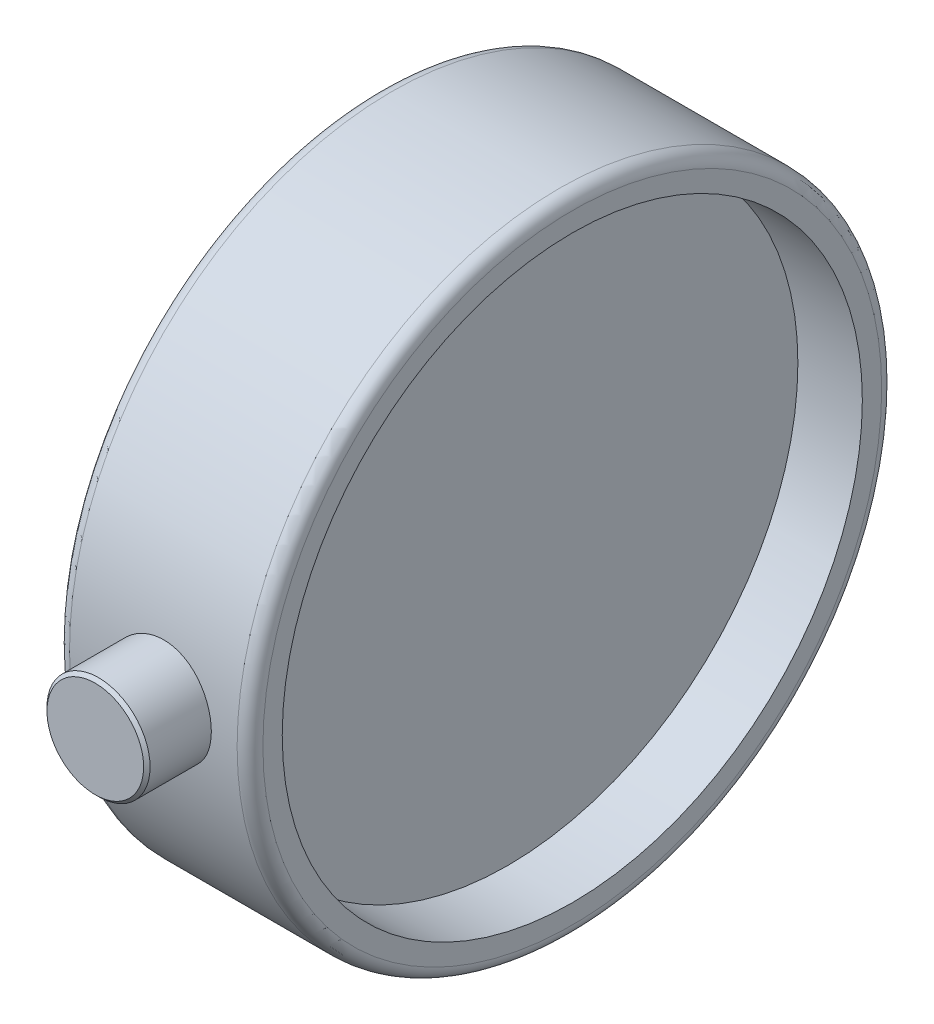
ISO-10303-21;
HEADER;
FILE_DESCRIPTION(('STEP AP214'),'2;1');
FILE_NAME('part.step','',(''),(''),'','','');
FILE_SCHEMA(('AUTOMOTIVE_DESIGN { 1 0 10303 214 1 1 1 1 }'));
ENDSEC;
DATA;
#1=APPLICATION_CONTEXT('core data for automotive mechanical design processes');
#2=APPLICATION_PROTOCOL_DEFINITION('international standard','automotive_design',2000,#1);
#3=PRODUCT_CONTEXT('',#1,'mechanical');
#4=PRODUCT('Part','Part','',(#3));
#5=PRODUCT_RELATED_PRODUCT_CATEGORY('part','',(#4));
#6=PRODUCT_DEFINITION_FORMATION('','',#4);
#7=PRODUCT_DEFINITION_CONTEXT('part definition',#1,'design');
#8=PRODUCT_DEFINITION('design','',#6,#7);
#9=PRODUCT_DEFINITION_SHAPE('','',#8);
#10=(LENGTH_UNIT() NAMED_UNIT(*) SI_UNIT(.MILLI.,.METRE.));
#11=(NAMED_UNIT(*) PLANE_ANGLE_UNIT() SI_UNIT($,.RADIAN.));
#12=(NAMED_UNIT(*) SI_UNIT($,.STERADIAN.) SOLID_ANGLE_UNIT());
#13=UNCERTAINTY_MEASURE_WITH_UNIT(LENGTH_MEASURE(1.E-05),#10,'distance_accuracy_value','');
#14=(GEOMETRIC_REPRESENTATION_CONTEXT(3) GLOBAL_UNCERTAINTY_ASSIGNED_CONTEXT((#13)) GLOBAL_UNIT_ASSIGNED_CONTEXT((#10,
#11,#12)) REPRESENTATION_CONTEXT('',''));
#15=CARTESIAN_POINT('',(0.,0.,0.));
#16=DIRECTION('',(0.,0.,1.));
#17=DIRECTION('',(1.,0.,0.));
#18=AXIS2_PLACEMENT_3D('',#15,#16,#17);
#19=CARTESIAN_POINT('',(20.,0.,0.));
#20=DIRECTION('',(1.,0.,0.));
#21=DIRECTION('',(0.,0.,-1.));
#22=AXIS2_PLACEMENT_3D('',#19,#20,#21);
#23=PLANE('',#22);
#24=CARTESIAN_POINT('',(20.,0.,0.));
#25=DIRECTION('',(1.,0.,0.));
#26=DIRECTION('',(0.,0.,-1.));
#27=AXIS2_PLACEMENT_3D('',#24,#25,#26);
#28=CIRCLE('',#27,45.);
#29=CARTESIAN_POINT('',(20.,0.,-45.));
#30=VERTEX_POINT('',#29);
#31=EDGE_CURVE('E142',#30,#30,#28,.T.);
#32=ORIENTED_EDGE('',*,*,#31,.T.);
#33=EDGE_LOOP('',(#32));
#34=FACE_BOUND('',#33,.T.);
#35=ADVANCED_FACE('F16',(#34),#23,.T.);
#36=CARTESIAN_POINT('',(30.,0.,0.));
#37=DIRECTION('',(1.,0.,0.));
#38=DIRECTION('',(0.,0.,-1.));
#39=AXIS2_PLACEMENT_3D('',#36,#37,#38);
#40=CYLINDRICAL_SURFACE('',#39,45.);
#41=CARTESIAN_POINT('',(30.,0.,0.));
#42=DIRECTION('',(1.,0.,0.));
#43=DIRECTION('',(0.,0.,-1.));
#44=AXIS2_PLACEMENT_3D('',#41,#42,#43);
#45=CIRCLE('',#44,45.);
#46=CARTESIAN_POINT('',(30.,0.,-45.));
#47=VERTEX_POINT('',#46);
#48=EDGE_CURVE('E152',#47,#47,#45,.F.);
#49=ORIENTED_EDGE('',*,*,#48,.F.);
#50=EDGE_LOOP('',(#49));
#51=FACE_BOUND('',#50,.T.);
#52=ORIENTED_EDGE('',*,*,#31,.F.);
#53=EDGE_LOOP('',(#52));
#54=FACE_BOUND('',#53,.T.);
#55=ADVANCED_FACE('F160',(#51,#54),#40,.F.);
#56=CARTESIAN_POINT('',(0.,0.,60.));
#57=DIRECTION('',(0.,0.,1.));
#58=DIRECTION('',(1.,0.,0.));
#59=AXIS2_PLACEMENT_3D('',#56,#57,#58);
#60=PLANE('',#59);
#61=CARTESIAN_POINT('',(16.,0.,60.));
#62=DIRECTION('',(0.,0.,-1.));
#63=DIRECTION('',(0.,1.,0.));
#64=AXIS2_PLACEMENT_3D('',#61,#62,#63);
#65=CIRCLE('',#64,7.5);
#66=CARTESIAN_POINT('',(16.,7.5,60.));
#67=VERTEX_POINT('',#66);
#68=EDGE_CURVE('E48',#67,#67,#65,.T.);
#69=ORIENTED_EDGE('',*,*,#68,.F.);
#70=EDGE_LOOP('',(#69));
#71=FACE_BOUND('',#70,.T.);
#72=ADVANCED_FACE('F158',(#71),#60,.T.);
#73=CARTESIAN_POINT('',(30.,0.,0.));
#74=DIRECTION('',(1.,0.,0.));
#75=DIRECTION('',(0.,0.,-1.));
#76=AXIS2_PLACEMENT_3D('',#73,#74,#75);
#77=PLANE('',#76);
#78=ORIENTED_EDGE('',*,*,#48,.T.);
#79=EDGE_LOOP('',(#78));
#80=FACE_BOUND('',#79,.T.);
#81=CARTESIAN_POINT('',(29.9999999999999,0.,0.));
#82=DIRECTION('',(-1.,0.,0.));
#83=DIRECTION('',(0.,0.,1.));
#84=AXIS2_PLACEMENT_3D('',#81,#82,#83);
#85=CIRCLE('',#84,47.99999933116);
#86=CARTESIAN_POINT('',(30.,0.,47.999999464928));
#87=VERTEX_POINT('',#86);
#88=CARTESIAN_POINT('',(30.,0.,-47.999999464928));
#89=VERTEX_POINT('',#88);
#90=EDGE_CURVE('E41',#87,#89,#85,.T.);
#91=ORIENTED_EDGE('',*,*,#90,.F.);
#92=CARTESIAN_POINT('',(30.,0.,0.));
#93=DIRECTION('',(-1.,0.,0.));
#94=DIRECTION('',(0.,0.,-1.));
#95=AXIS2_PLACEMENT_3D('',#92,#93,#94);
#96=CIRCLE('',#95,47.99999966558);
#97=EDGE_CURVE('E46',#89,#87,#96,.T.);
#98=ORIENTED_EDGE('',*,*,#97,.F.);
#99=EDGE_LOOP('',(#91,#98));
#100=FACE_BOUND('',#99,.T.);
#101=ADVANCED_FACE('F45',(#80,#100),#77,.T.);
#102=CARTESIAN_POINT('',(16.,0.,59.5));
#103=DIRECTION('',(0.,0.,-1.));
#104=DIRECTION('',(0.,1.,0.));
#105=AXIS2_PLACEMENT_3D('',#102,#103,#104);
#106=CONICAL_SURFACE('',#105,8.,0.785398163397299);
#107=CARTESIAN_POINT('',(16.,0.,59.5));
#108=DIRECTION('',(0.,0.,1.));
#109=DIRECTION('',(1.,0.,0.));
#110=AXIS2_PLACEMENT_3D('',#107,#108,#109);
#111=CIRCLE('',#110,8.);
#112=CARTESIAN_POINT('',(24.,0.,59.5));
#113=VERTEX_POINT('',#112);
#114=EDGE_CURVE('E53',#113,#113,#111,.F.);
#115=ORIENTED_EDGE('',*,*,#114,.F.);
#116=EDGE_LOOP('',(#115));
#117=FACE_BOUND('',#116,.T.);
#118=ORIENTED_EDGE('',*,*,#68,.T.);
#119=EDGE_LOOP('',(#118));
#120=FACE_BOUND('',#119,.T.);
#121=ADVANCED_FACE('F79',(#117,#120),#106,.T.);
#122=CARTESIAN_POINT('',(28.,0.,0.));
#123=DIRECTION('',(1.,0.,0.));
#124=DIRECTION('',(0.,0.00466381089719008,0.999989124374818));
#125=AXIS2_PLACEMENT_3D('',#122,#123,#124);
#126=TOROIDAL_SURFACE('',#125,48.,2.);
#127=CARTESIAN_POINT('',(28.,0.,0.));
#128=DIRECTION('',(1.,0.,0.));
#129=DIRECTION('',(0.,0.,-1.));
#130=AXIS2_PLACEMENT_3D('',#127,#128,#129);
#131=CIRCLE('',#130,50.);
#132=CARTESIAN_POINT('',(28.,0.,-50.));
#133=VERTEX_POINT('',#132);
#134=EDGE_CURVE('E85',#133,#133,#131,.F.);
#135=ORIENTED_EDGE('',*,*,#134,.F.);
#136=EDGE_LOOP('',(#135));
#137=FACE_BOUND('',#136,.T.);
#138=ORIENTED_EDGE('',*,*,#97,.T.);
#139=ORIENTED_EDGE('',*,*,#90,.T.);
#140=EDGE_LOOP('',(#138,#139));
#141=FACE_BOUND('',#140,.T.);
#142=ADVANCED_FACE('F52',(#137,#141),#126,.T.);
#143=CARTESIAN_POINT('',(16.,0.,0.));
#144=DIRECTION('',(0.,0.,1.));
#145=DIRECTION('',(1.,0.,0.));
#146=AXIS2_PLACEMENT_3D('',#143,#144,#145);
#147=CYLINDRICAL_SURFACE('',#146,8.);
#148=ORIENTED_EDGE('',*,*,#114,.T.);
#149=EDGE_LOOP('',(#148));
#150=FACE_BOUND('',#149,.T.);
#151=CARTESIAN_POINT('',(24.,0.,50.));
#152=CARTESIAN_POINT('',(23.9999988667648,-0.223034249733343,49.9999995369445));
#153=CARTESIAN_POINT('',(23.9906650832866,-0.446100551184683,49.9985037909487));
#154=CARTESIAN_POINT('',(23.9533905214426,-0.89072063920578,49.9925603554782));
#155=CARTESIAN_POINT('',(23.9254410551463,-1.11227367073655,49.9881112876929));
#156=CARTESIAN_POINT('',(23.8510756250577,-1.55259435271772,49.9763747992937));
#157=CARTESIAN_POINT('',(23.8046267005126,-1.77135630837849,49.9690823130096));
#158=CARTESIAN_POINT('',(23.693614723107,-2.20413268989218,49.9518638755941));
#159=CARTESIAN_POINT('',(23.6290511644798,-2.4181469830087,49.941937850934));
#160=CARTESIAN_POINT('',(23.4823866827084,-2.83965163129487,49.9197442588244));
#161=CARTESIAN_POINT('',(23.4003078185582,-3.04714981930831,49.9074796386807));
#162=CARTESIAN_POINT('',(23.219164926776,-3.45446664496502,49.8809414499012));
#163=CARTESIAN_POINT('',(23.1201004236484,-3.65428506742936,49.8666678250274));
#164=CARTESIAN_POINT('',(22.9057628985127,-4.04475111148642,49.8365158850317));
#165=CARTESIAN_POINT('',(22.7904992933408,-4.23540397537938,49.8206385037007));
#166=CARTESIAN_POINT('',(22.5444901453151,-4.60643161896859,49.7877042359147));
#167=CARTESIAN_POINT('',(22.413739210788,-4.78680278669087,49.7706469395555));
#168=CARTESIAN_POINT('',(22.1366352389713,-5.13731450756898,49.7356940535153));
#169=CARTESIAN_POINT('',(21.9901703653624,-5.30736611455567,49.7177930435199));
#170=CARTESIAN_POINT('',(21.6834330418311,-5.63461649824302,49.6817694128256));
#171=CARTESIAN_POINT('',(21.5231555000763,-5.7918104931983,49.6636467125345));
#172=CARTESIAN_POINT('',(21.1899551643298,-6.09218125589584,49.6276960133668));
#173=CARTESIAN_POINT('',(21.0170333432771,-6.23535910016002,49.6098679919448));
#174=CARTESIAN_POINT('',(20.6597176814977,-6.50671646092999,49.5750074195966));
#175=CARTESIAN_POINT('',(20.47532369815,-6.63489579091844,49.5579748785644));
#176=CARTESIAN_POINT('',(20.0952655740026,-6.87602575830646,49.5250963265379));
#177=CARTESIAN_POINT('',(19.8995438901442,-6.9888867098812,49.5092575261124));
#178=CARTESIAN_POINT('',(19.499145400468,-7.19770543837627,49.4793307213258));
#179=CARTESIAN_POINT('',(19.2944683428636,-7.29366273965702,49.4652427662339));
#180=CARTESIAN_POINT('',(18.8776698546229,-7.46793304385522,49.4392328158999));
#181=CARTESIAN_POINT('',(18.6655505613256,-7.54625106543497,49.4273102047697));
#182=CARTESIAN_POINT('',(18.235236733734,-7.68471357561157,49.4059722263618));
#183=CARTESIAN_POINT('',(18.0170396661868,-7.74485035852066,49.3965579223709));
#184=CARTESIAN_POINT('',(17.5781101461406,-7.84600919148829,49.3805907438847));
#185=CARTESIAN_POINT('',(17.3574149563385,-7.8871892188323,49.3740142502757));
#186=CARTESIAN_POINT('',(16.9133744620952,-7.95085091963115,49.3638026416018));
#187=CARTESIAN_POINT('',(16.6900303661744,-7.9733408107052,49.3601662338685));
#188=CARTESIAN_POINT('',(16.2421771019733,-7.9994795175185,49.3559368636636));
#189=CARTESIAN_POINT('',(16.0176677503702,-8.00312527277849,49.3553443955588));
#190=CARTESIAN_POINT('',(15.5691506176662,-7.99153886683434,49.3572217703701));
#191=CARTESIAN_POINT('',(15.3451428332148,-7.97630683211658,49.3596915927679));
#192=CARTESIAN_POINT('',(14.9013725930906,-7.9273184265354,49.3675827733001));
#193=CARTESIAN_POINT('',(14.6815900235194,-7.89373944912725,49.3729758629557));
#194=CARTESIAN_POINT('',(14.2456613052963,-7.80843287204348,49.3865390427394));
#195=CARTESIAN_POINT('',(14.0295151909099,-7.75670510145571,49.3947091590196));
#196=CARTESIAN_POINT('',(13.6023701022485,-7.63548687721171,49.4135922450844));
#197=CARTESIAN_POINT('',(13.3913713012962,-7.56599582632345,49.4243053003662));
#198=CARTESIAN_POINT('',(12.9759944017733,-7.40976561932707,49.4479687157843));
#199=CARTESIAN_POINT('',(12.7716161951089,-7.3230267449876,49.460919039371));
#200=CARTESIAN_POINT('',(12.369975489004,-7.13249940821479,49.4887538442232));
#201=CARTESIAN_POINT('',(12.1727490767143,-7.02863611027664,49.5036467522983));
#202=CARTESIAN_POINT('',(11.7877355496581,-6.8048808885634,49.5349003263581));
#203=CARTESIAN_POINT('',(11.5999483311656,-6.68498914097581,49.5512609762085));
#204=CARTESIAN_POINT('',(11.2350515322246,-6.42999360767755,49.5849948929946));
#205=CARTESIAN_POINT('',(11.0579438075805,-6.29488718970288,49.6023683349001));
#206=CARTESIAN_POINT('',(10.715698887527,-6.01046190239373,49.6376356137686));
#207=CARTESIAN_POINT('',(10.5505574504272,-5.86114811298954,49.6555292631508));
#208=CARTESIAN_POINT('',(10.2314499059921,-5.5474735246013,49.6915560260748));
#209=CARTESIAN_POINT('',(10.0776355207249,-5.38295837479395,49.7096895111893));
#210=CARTESIAN_POINT('',(9.78444659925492,-5.0415775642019,49.7454714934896));
#211=CARTESIAN_POINT('',(9.64506717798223,-4.86471611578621,49.7631201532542));
#212=CARTESIAN_POINT('',(9.38158345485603,-4.49969556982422,49.7974533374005));
#213=CARTESIAN_POINT('',(9.25748901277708,-4.3115292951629,49.8141372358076));
#214=CARTESIAN_POINT('',(9.02557159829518,-3.92531317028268,49.846057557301));
#215=CARTESIAN_POINT('',(8.91774810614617,-3.72726363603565,49.8612940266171));
#216=CARTESIAN_POINT('',(8.71899717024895,-3.32234017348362,49.889911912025));
#217=CARTESIAN_POINT('',(8.62809668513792,-3.11545280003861,49.9032903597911));
#218=CARTESIAN_POINT('',(8.46408388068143,-2.69461774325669,49.9277823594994));
#219=CARTESIAN_POINT('',(8.39097102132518,-2.4806702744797,49.9388959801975));
#220=CARTESIAN_POINT('',(8.26320573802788,-2.04765272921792,49.9585228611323));
#221=CARTESIAN_POINT('',(8.20851927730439,-1.82859290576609,49.9670409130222));
#222=CARTESIAN_POINT('',(8.11786238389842,-1.38663464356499,49.9812572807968));
#223=CARTESIAN_POINT('',(8.08188293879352,-1.16373810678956,49.9869569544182));
#224=CARTESIAN_POINT('',(8.03694439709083,-0.783836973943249,49.9940990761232));
#225=CARTESIAN_POINT('',(8.0230956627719,-0.627407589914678,49.9963090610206));
#226=CARTESIAN_POINT('',(8.00462306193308,-0.313990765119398,49.9992596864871));
#227=CARTESIAN_POINT('',(7.99999920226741,-0.157003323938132,50.0000003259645));
#228=CARTESIAN_POINT('',(8.00000113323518,0.223034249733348,49.9999995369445));
#229=CARTESIAN_POINT('',(8.00933491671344,0.446100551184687,49.9985037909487));
#230=CARTESIAN_POINT('',(8.04660947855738,0.890720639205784,49.9925603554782));
#231=CARTESIAN_POINT('',(8.0745589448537,1.11227367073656,49.9881112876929));
#232=CARTESIAN_POINT('',(8.14892437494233,1.55259435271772,49.9763747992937));
#233=CARTESIAN_POINT('',(8.19537329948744,1.77135630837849,49.9690823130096));
#234=CARTESIAN_POINT('',(8.30638527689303,2.20413268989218,49.9518638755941));
#235=CARTESIAN_POINT('',(8.37094883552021,2.4181469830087,49.941937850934));
#236=CARTESIAN_POINT('',(8.51761331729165,2.83965163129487,49.9197442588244));
#237=CARTESIAN_POINT('',(8.5996921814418,3.04714981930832,49.9074796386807));
#238=CARTESIAN_POINT('',(8.78083507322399,3.45446664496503,49.8809414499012));
#239=CARTESIAN_POINT('',(8.87989957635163,3.65428506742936,49.8666678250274));
#240=CARTESIAN_POINT('',(9.09423710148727,4.04475111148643,49.8365158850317));
#241=CARTESIAN_POINT('',(9.20950070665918,4.23540397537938,49.8206385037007));
#242=CARTESIAN_POINT('',(9.45550985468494,4.60643161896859,49.7877042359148));
#243=CARTESIAN_POINT('',(9.58626078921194,4.78680278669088,49.7706469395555));
#244=CARTESIAN_POINT('',(9.86336476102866,5.13731450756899,49.7356940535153));
#245=CARTESIAN_POINT('',(10.0098296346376,5.30736611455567,49.7177930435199));
#246=CARTESIAN_POINT('',(10.3165669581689,5.63461649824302,49.6817694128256));
#247=CARTESIAN_POINT('',(10.4768444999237,5.7918104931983,49.6636467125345));
#248=CARTESIAN_POINT('',(10.8100448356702,6.09218125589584,49.6276960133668));
#249=CARTESIAN_POINT('',(10.9829666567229,6.23535910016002,49.6098679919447));
#250=CARTESIAN_POINT('',(11.3402823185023,6.50671646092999,49.5750074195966));
#251=CARTESIAN_POINT('',(11.52467630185,6.63489579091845,49.5579748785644));
#252=CARTESIAN_POINT('',(11.9047344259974,6.87602575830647,49.5250963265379));
#253=CARTESIAN_POINT('',(12.1004561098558,6.98888670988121,49.5092575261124));
#254=CARTESIAN_POINT('',(12.500854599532,7.19770543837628,49.4793307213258));
#255=CARTESIAN_POINT('',(12.7055316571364,7.29366273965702,49.4652427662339));
#256=CARTESIAN_POINT('',(13.1223301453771,7.46793304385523,49.4392328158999));
#257=CARTESIAN_POINT('',(13.3344494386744,7.54625106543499,49.4273102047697));
#258=CARTESIAN_POINT('',(13.7647632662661,7.68471357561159,49.4059722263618));
#259=CARTESIAN_POINT('',(13.9829603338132,7.74485035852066,49.3965579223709));
#260=CARTESIAN_POINT('',(14.4218898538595,7.84600919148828,49.3805907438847));
#261=CARTESIAN_POINT('',(14.6425850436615,7.8871892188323,49.3740142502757));
#262=CARTESIAN_POINT('',(15.0866255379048,7.95085091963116,49.3638026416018));
#263=CARTESIAN_POINT('',(15.3099696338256,7.9733408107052,49.3601662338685));
#264=CARTESIAN_POINT('',(15.7578228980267,7.9994795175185,49.3559368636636));
#265=CARTESIAN_POINT('',(15.9823322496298,8.00312527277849,49.3553443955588));
#266=CARTESIAN_POINT('',(16.4308493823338,7.99153886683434,49.3572217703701));
#267=CARTESIAN_POINT('',(16.6548571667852,7.97630683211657,49.3596915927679));
#268=CARTESIAN_POINT('',(17.0986274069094,7.92731842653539,49.3675827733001));
#269=CARTESIAN_POINT('',(17.3184099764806,7.89373944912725,49.3729758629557));
#270=CARTESIAN_POINT('',(17.7543386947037,7.80843287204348,49.3865390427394));
#271=CARTESIAN_POINT('',(17.9704848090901,7.75670510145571,49.3947091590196));
#272=CARTESIAN_POINT('',(18.3976298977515,7.63548687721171,49.4135922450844));
#273=CARTESIAN_POINT('',(18.6086286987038,7.56599582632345,49.4243053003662));
#274=CARTESIAN_POINT('',(19.0240055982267,7.40976561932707,49.4479687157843));
#275=CARTESIAN_POINT('',(19.2283838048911,7.3230267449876,49.460919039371));
#276=CARTESIAN_POINT('',(19.6300245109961,7.13249940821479,49.4887538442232));
#277=CARTESIAN_POINT('',(19.8272509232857,7.02863611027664,49.5036467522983));
#278=CARTESIAN_POINT('',(20.2122644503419,6.8048808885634,49.5349003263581));
#279=CARTESIAN_POINT('',(20.4000516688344,6.68498914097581,49.5512609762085));
#280=CARTESIAN_POINT('',(20.7649484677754,6.42999360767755,49.5849948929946));
#281=CARTESIAN_POINT('',(20.9420561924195,6.29488718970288,49.6023683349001));
#282=CARTESIAN_POINT('',(21.284301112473,6.01046190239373,49.6376356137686));
#283=CARTESIAN_POINT('',(21.4494425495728,5.86114811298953,49.6555292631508));
#284=CARTESIAN_POINT('',(21.7685500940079,5.54747352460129,49.6915560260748));
#285=CARTESIAN_POINT('',(21.9223644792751,5.38295837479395,49.7096895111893));
#286=CARTESIAN_POINT('',(22.2155534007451,5.0415775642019,49.7454714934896));
#287=CARTESIAN_POINT('',(22.3549328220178,4.86471611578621,49.7631201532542));
#288=CARTESIAN_POINT('',(22.618416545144,4.49969556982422,49.7974533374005));
#289=CARTESIAN_POINT('',(22.7425109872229,4.3115292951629,49.8141372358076));
#290=CARTESIAN_POINT('',(22.9744284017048,3.92531317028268,49.846057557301));
#291=CARTESIAN_POINT('',(23.0822518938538,3.72726363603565,49.8612940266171));
#292=CARTESIAN_POINT('',(23.281002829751,3.32234017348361,49.889911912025));
#293=CARTESIAN_POINT('',(23.3719033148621,3.11545280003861,49.9032903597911));
#294=CARTESIAN_POINT('',(23.5359161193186,2.69461774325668,49.9277823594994));
#295=CARTESIAN_POINT('',(23.6090289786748,2.4806702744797,49.9388959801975));
#296=CARTESIAN_POINT('',(23.7367942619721,2.04765272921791,49.9585228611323));
#297=CARTESIAN_POINT('',(23.7914807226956,1.82859290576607,49.9670409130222));
#298=CARTESIAN_POINT('',(23.8821376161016,1.38663464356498,49.9812572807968));
#299=CARTESIAN_POINT('',(23.9181170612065,1.16373810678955,49.9869569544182));
#300=CARTESIAN_POINT('',(23.9630556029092,0.783836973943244,49.9940990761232));
#301=CARTESIAN_POINT('',(23.9769043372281,0.627407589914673,49.9963090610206));
#302=CARTESIAN_POINT('',(23.9953769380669,0.313990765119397,49.9992596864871));
#303=CARTESIAN_POINT('',(24.0000007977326,0.157003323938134,50.0000003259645));
#304=CARTESIAN_POINT('',(24.,0.,50.));
#305=B_SPLINE_CURVE_WITH_KNOTS('',3,(#151,#152,#153,#154,#155,#156,#157,#158,#159,#160,#161,
#162,#163,#164,#165,#166,#167,#168,#169,#170,#171,#172,#173,#174,#175,#176,#177,#178,#179,#180,
#181,#182,#183,#184,#185,#186,#187,#188,#189,#190,#191,#192,#193,#194,#195,#196,#197,#198,#199,
#200,#201,#202,#203,#204,#205,#206,#207,#208,#209,#210,#211,#212,#213,#214,#215,#216,#217,#218,
#219,#220,#221,#222,#223,#224,#225,#226,#227,#228,#229,#230,#231,#232,#233,#234,#235,#236,#237,
#238,#239,#240,#241,#242,#243,#244,#245,#246,#247,#248,#249,#250,#251,#252,#253,#254,#255,#256,
#257,#258,#259,#260,#261,#262,#263,#264,#265,#266,#267,#268,#269,#270,#271,#272,#273,#274,#275,
#276,#277,#278,#279,#280,#281,#282,#283,#284,#285,#286,#287,#288,#289,#290,#291,#292,#293,#294,
#295,#296,#297,#298,#299,#300,#301,#302,#303,#304),.UNSPECIFIED.,.T.,.F.,(4,2,2,2,2,2,2,2,2,2,2,
2,2,2,2,2,2,2,2,2,2,2,2,2,2,2,2,2,2,2,2,2,2,2,2,2,2,2,2,2,2,2,2,2,2,2,2,2,2,2,2,2,2,2,2,2,2,2,2,
2,2,2,2,2,2,2,2,2,2,2,2,2,2,2,2,2,4),(0.,0.668958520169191,1.33822946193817,2.00869822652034,
2.67918571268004,3.3488337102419,4.01850045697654,4.68777951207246,5.3572922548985,
6.03193327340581,6.70682406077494,7.3816629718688,8.05651027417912,8.7351523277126,
9.41381347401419,10.0922812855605,10.7710362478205,11.4440275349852,12.1167227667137,
12.789527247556,13.462327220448,14.1287342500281,14.7951475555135,15.4615832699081,
16.1280080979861,16.7974264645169,17.46683747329,18.1363644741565,18.8056529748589,
19.4826992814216,20.1595157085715,20.8367664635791,21.5139955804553,22.1922944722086,
22.8705727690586,23.547591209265,24.2242831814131,24.6951912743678,25.166099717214,
25.8350582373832,26.5043291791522,27.1747979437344,27.8452854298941,28.5149334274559,
29.1846001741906,29.8538792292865,30.5233919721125,31.1980329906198,31.872923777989,
32.5477626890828,33.2226099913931,33.9012520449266,34.5799131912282,35.2583810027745,
35.9371359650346,36.6101272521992,37.2828224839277,37.95562696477,38.628426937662,
39.2948339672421,39.9612472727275,40.6276829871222,41.2941078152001,41.9635261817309,
42.632937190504,43.3024641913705,43.971752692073,44.6487989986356,45.3256154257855,
46.0028661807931,46.6800952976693,47.3583941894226,48.0366724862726,48.7136909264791,
49.3903828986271,49.8612909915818,50.332199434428),.UNSPECIFIED.);
#306=CARTESIAN_POINT('',(24.,0.,50.));
#307=VERTEX_POINT('',#306);
#308=EDGE_CURVE('E62',#307,#307,#305,.T.);
#309=ORIENTED_EDGE('',*,*,#308,.F.);
#310=EDGE_LOOP('',(#309));
#311=FACE_BOUND('',#310,.T.);
#312=ADVANCED_FACE('F78',(#150,#311),#147,.T.);
#313=CARTESIAN_POINT('',(0.,0.,0.));
#314=DIRECTION('',(1.,0.,0.));
#315=DIRECTION('',(0.,0.,-1.));
#316=AXIS2_PLACEMENT_3D('',#313,#314,#315);
#317=CYLINDRICAL_SURFACE('',#316,50.);
#318=ORIENTED_EDGE('',*,*,#134,.T.);
#319=EDGE_LOOP('',(#318));
#320=FACE_BOUND('',#319,.T.);
#321=ORIENTED_EDGE('',*,*,#308,.T.);
#322=EDGE_LOOP('',(#321));
#323=FACE_BOUND('',#322,.T.);
#324=CARTESIAN_POINT('',(2.,0.,0.));
#325=DIRECTION('',(1.,0.,0.));
#326=DIRECTION('',(0.,0.00662517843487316,-0.999978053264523));
#327=AXIS2_PLACEMENT_3D('',#324,#325,#326);
#328=CIRCLE('',#327,50.);
#329=CARTESIAN_POINT('',(2.,0.331258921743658,-49.9989026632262));
#330=VERTEX_POINT('',#329);
#331=EDGE_CURVE('E94',#330,#330,#328,.F.);
#332=ORIENTED_EDGE('',*,*,#331,.F.);
#333=EDGE_LOOP('',(#332));
#334=FACE_BOUND('',#333,.T.);
#335=ADVANCED_FACE('F116',(#320,#323,#334),#317,.T.);
#336=CARTESIAN_POINT('',(2.,0.,0.));
#337=DIRECTION('',(1.,0.,0.));
#338=DIRECTION('',(0.,0.00662517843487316,-0.999978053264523));
#339=AXIS2_PLACEMENT_3D('',#336,#337,#338);
#340=TOROIDAL_SURFACE('',#339,48.,2.);
#341=ORIENTED_EDGE('',*,*,#331,.T.);
#342=EDGE_LOOP('',(#341));
#343=FACE_BOUND('',#342,.T.);
#344=CARTESIAN_POINT('',(0.,0.,0.));
#345=DIRECTION('',(1.,0.,0.));
#346=DIRECTION('',(0.,0.,1.));
#347=AXIS2_PLACEMENT_3D('',#344,#345,#346);
#348=CIRCLE('',#347,47.99999966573);
#349=CARTESIAN_POINT('',(0.,0.,47.999999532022));
#350=VERTEX_POINT('',#349);
#351=CARTESIAN_POINT('',(0.,0.,-47.999999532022));
#352=VERTEX_POINT('',#351);
#353=EDGE_CURVE('E11',#350,#352,#348,.T.);
#354=ORIENTED_EDGE('',*,*,#353,.T.);
#355=CARTESIAN_POINT('',(1.14058068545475E-13,0.,0.));
#356=DIRECTION('',(1.,0.,0.));
#357=DIRECTION('',(0.,0.,-1.));
#358=AXIS2_PLACEMENT_3D('',#355,#356,#357);
#359=CIRCLE('',#358,47.99999933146);
#360=EDGE_CURVE('E27',#352,#350,#359,.T.);
#361=ORIENTED_EDGE('',*,*,#360,.T.);
#362=EDGE_LOOP('',(#354,#361));
#363=FACE_BOUND('',#362,.T.);
#364=ADVANCED_FACE('F106',(#343,#363),#340,.T.);
#365=CARTESIAN_POINT('',(0.,0.,0.));
#366=DIRECTION('',(1.,0.,0.));
#367=DIRECTION('',(0.,0.,-1.));
#368=AXIS2_PLACEMENT_3D('',#365,#366,#367);
#369=PLANE('',#368);
#370=ORIENTED_EDGE('',*,*,#360,.F.);
#371=ORIENTED_EDGE('',*,*,#353,.F.);
#372=EDGE_LOOP('',(#370,#371));
#373=FACE_BOUND('',#372,.T.);
#374=ADVANCED_FACE('F115',(#373),#369,.F.);
#375=CLOSED_SHELL('',(#35,#55,#72,#101,#121,#142,#312,#335,#364,#374));
#376=MANIFOLD_SOLID_BREP('B1',#375);
#377=ADVANCED_BREP_SHAPE_REPRESENTATION('',(#18,#376),#14);
#378=SHAPE_DEFINITION_REPRESENTATION(#9,#377);
ENDSEC;
END-ISO-10303-21;
